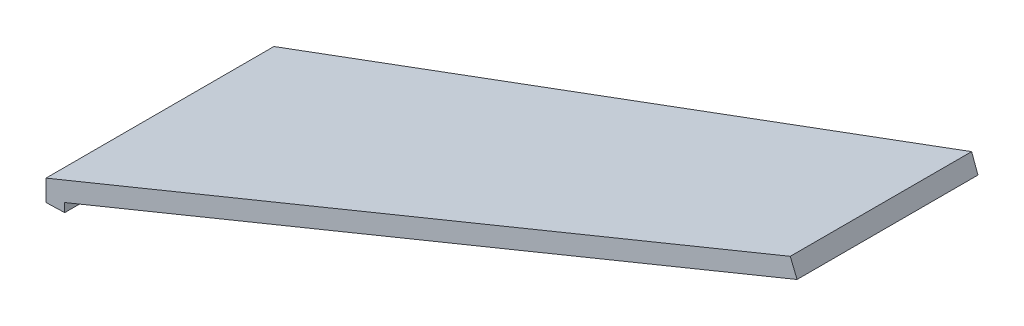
ISO-10303-21;
HEADER;
FILE_DESCRIPTION(('STEP AP214'),'2;1');
FILE_NAME('part.step','',(''),(''),'','','');
FILE_SCHEMA(('AUTOMOTIVE_DESIGN { 1 0 10303 214 1 1 1 1 }'));
ENDSEC;
DATA;
#1=APPLICATION_CONTEXT('core data for automotive mechanical design processes');
#2=APPLICATION_PROTOCOL_DEFINITION('international standard','automotive_design',2000,#1);
#3=PRODUCT_CONTEXT('',#1,'mechanical');
#4=PRODUCT('Part','Part','',(#3));
#5=PRODUCT_RELATED_PRODUCT_CATEGORY('part','',(#4));
#6=PRODUCT_DEFINITION_FORMATION('','',#4);
#7=PRODUCT_DEFINITION_CONTEXT('part definition',#1,'design');
#8=PRODUCT_DEFINITION('design','',#6,#7);
#9=PRODUCT_DEFINITION_SHAPE('','',#8);
#10=(LENGTH_UNIT() NAMED_UNIT(*) SI_UNIT(.MILLI.,.METRE.));
#11=(NAMED_UNIT(*) PLANE_ANGLE_UNIT() SI_UNIT($,.RADIAN.));
#12=(NAMED_UNIT(*) SI_UNIT($,.STERADIAN.) SOLID_ANGLE_UNIT());
#13=UNCERTAINTY_MEASURE_WITH_UNIT(LENGTH_MEASURE(1.E-05),#10,'distance_accuracy_value','');
#14=(GEOMETRIC_REPRESENTATION_CONTEXT(3) GLOBAL_UNCERTAINTY_ASSIGNED_CONTEXT((#13)) GLOBAL_UNIT_ASSIGNED_CONTEXT((#10,
#11,#12)) REPRESENTATION_CONTEXT('',''));
#15=CARTESIAN_POINT('',(0.,0.,0.));
#16=DIRECTION('',(0.,0.,1.));
#17=DIRECTION('',(1.,0.,0.));
#18=AXIS2_PLACEMENT_3D('',#15,#16,#17);
#19=CARTESIAN_POINT('',(-0.3,0.35,-2.));
#20=DIRECTION('',(-0.363251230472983,0.931691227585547,0.));
#21=DIRECTION('',(-0.931691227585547,-0.363251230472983,0.));
#22=AXIS2_PLACEMENT_3D('',#19,#20,#21);
#23=PLANE('',#22);
#24=DIRECTION('',(0.,0.,1.));
#25=VECTOR('',#24,1.);
#26=CARTESIAN_POINT('',(11.625647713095,4.99961575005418,-2.));
#27=LINE('',#26,#25);
#28=CARTESIAN_POINT('',(11.625647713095,4.99961575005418,-1.49991532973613));
#29=VERTEX_POINT('',#28);
#30=CARTESIAN_POINT('',(11.625647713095,4.99961575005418,1.49991532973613));
#31=VERTEX_POINT('',#30);
#32=EDGE_CURVE('E10',#29,#31,#27,.T.);
#33=ORIENTED_EDGE('',*,*,#32,.F.);
#34=DIRECTION('',(-0.931269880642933,-0.363086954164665,-0.0300711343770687));
#35=VECTOR('',#34,1.);
#36=CARTESIAN_POINT('',(-0.303220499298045,0.348744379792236,-1.88510399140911));
#37=LINE('',#36,#35);
#38=CARTESIAN_POINT('',(-0.3,0.35,-1.885));
#39=VERTEX_POINT('',#38);
#40=EDGE_CURVE('E108',#29,#39,#37,.T.);
#41=ORIENTED_EDGE('',*,*,#40,.T.);
#42=DIRECTION('',(0.,0.,1.));
#43=VECTOR('',#42,1.);
#44=CARTESIAN_POINT('',(-0.3,0.35,-2.));
#45=LINE('',#44,#43);
#46=CARTESIAN_POINT('',(-0.3,0.35,1.885));
#47=VERTEX_POINT('',#46);
#48=EDGE_CURVE('E19',#39,#47,#45,.T.);
#49=ORIENTED_EDGE('',*,*,#48,.T.);
#50=DIRECTION('',(0.931269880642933,0.363086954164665,-0.0300711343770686));
#51=VECTOR('',#50,1.);
#52=CARTESIAN_POINT('',(-0.191203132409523,0.392418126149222,1.88148689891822));
#53=LINE('',#52,#51);
#54=EDGE_CURVE('E94',#47,#31,#53,.T.);
#55=ORIENTED_EDGE('',*,*,#54,.T.);
#56=EDGE_LOOP('',(#33,#41,#49,#55));
#57=FACE_BOUND('',#56,.T.);
#58=ADVANCED_FACE('F16',(#57),#23,.T.);
#59=CARTESIAN_POINT('',(11.7346230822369,4.72010838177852,-2.));
#60=DIRECTION('',(0.931691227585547,0.363251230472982,0.));
#61=DIRECTION('',(-0.363251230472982,0.931691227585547,0.));
#62=AXIS2_PLACEMENT_3D('',#59,#60,#61);
#63=PLANE('',#62);
#64=DIRECTION('',(0.,0.,1.));
#65=VECTOR('',#64,1.);
#66=CARTESIAN_POINT('',(11.7346230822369,4.72010838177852,-2.));
#67=LINE('',#66,#65);
#68=CARTESIAN_POINT('',(11.7346230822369,4.72010838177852,-1.49639646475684));
#69=VERTEX_POINT('',#68);
#70=CARTESIAN_POINT('',(11.7346230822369,4.72010838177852,1.49639646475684));
#71=VERTEX_POINT('',#70);
#72=EDGE_CURVE('E24',#69,#71,#67,.T.);
#73=ORIENTED_EDGE('',*,*,#72,.F.);
#74=DIRECTION('',(-0.363226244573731,0.931627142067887,-0.0117287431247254));
#75=VECTOR('',#74,1.);
#76=CARTESIAN_POINT('',(11.7324776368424,4.72561116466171,-1.4964657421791));
#77=LINE('',#76,#75);
#78=EDGE_CURVE('E110',#69,#29,#77,.T.);
#79=ORIENTED_EDGE('',*,*,#78,.T.);
#80=ORIENTED_EDGE('',*,*,#32,.T.);
#81=DIRECTION('',(0.363226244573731,-0.931627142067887,-0.0117287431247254));
#82=VECTOR('',#81,1.);
#83=CARTESIAN_POINT('',(11.7495183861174,4.68190390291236,1.49591548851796));
#84=LINE('',#83,#82);
#85=EDGE_CURVE('E96',#31,#71,#84,.T.);
#86=ORIENTED_EDGE('',*,*,#85,.T.);
#87=EDGE_LOOP('',(#73,#79,#80,#86));
#88=FACE_BOUND('',#87,.T.);
#89=ADVANCED_FACE('F121',(#88),#63,.T.);
#90=CARTESIAN_POINT('',(0.,0.144970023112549,-2.));
#91=DIRECTION('',(0.363251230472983,-0.931691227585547,0.));
#92=DIRECTION('',(0.931691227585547,0.363251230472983,0.));
#93=AXIS2_PLACEMENT_3D('',#90,#91,#92);
#94=PLANE('',#93);
#95=DIRECTION('',(0.,0.,1.));
#96=VECTOR('',#95,1.);
#97=CARTESIAN_POINT('',(0.,0.144970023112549,-2.));
#98=LINE('',#97,#96);
#99=CARTESIAN_POINT('',(0.,0.144970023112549,-1.87531286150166));
#100=VERTEX_POINT('',#99);
#101=CARTESIAN_POINT('',(0.,0.144970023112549,1.87531286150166));
#102=VERTEX_POINT('',#101);
#103=EDGE_CURVE('E89',#100,#102,#98,.T.);
#104=ORIENTED_EDGE('',*,*,#103,.F.);
#105=DIRECTION('',(0.931269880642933,0.363086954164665,0.0300711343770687));
#106=VECTOR('',#105,1.);
#107=CARTESIAN_POINT('',(-0.00349178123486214,0.14360863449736,-1.87542561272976));
#108=LINE('',#107,#106);
#109=EDGE_CURVE('E71',#100,#69,#108,.T.);
#110=ORIENTED_EDGE('',*,*,#109,.T.);
#111=ORIENTED_EDGE('',*,*,#72,.T.);
#112=DIRECTION('',(-0.931269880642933,-0.363086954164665,0.0300711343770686));
#113=VECTOR('',#112,1.);
#114=CARTESIAN_POINT('',(0.108525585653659,0.187282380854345,1.87180852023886));
#115=LINE('',#114,#113);
#116=EDGE_CURVE('E99',#71,#102,#115,.T.);
#117=ORIENTED_EDGE('',*,*,#116,.T.);
#118=EDGE_LOOP('',(#104,#110,#111,#117));
#119=FACE_BOUND('',#118,.T.);
#120=ADVANCED_FACE('F126',(#119),#94,.T.);
#121=CARTESIAN_POINT('',(0.,0.,-2.));
#122=DIRECTION('',(1.,0.,0.));
#123=DIRECTION('',(0.,1.,0.));
#124=AXIS2_PLACEMENT_3D('',#121,#122,#123);
#125=PLANE('',#124);
#126=DIRECTION('',(0.,0.,1.));
#127=VECTOR('',#126,1.);
#128=CARTESIAN_POINT('',(0.,0.,-2.));
#129=LINE('',#128,#127);
#130=CARTESIAN_POINT('',(0.,0.,-1.87531286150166));
#131=VERTEX_POINT('',#130);
#132=CARTESIAN_POINT('',(0.,0.,1.87531286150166));
#133=VERTEX_POINT('',#132);
#134=EDGE_CURVE('E81',#131,#133,#129,.T.);
#135=ORIENTED_EDGE('',*,*,#134,.F.);
#136=DIRECTION('',(0.,1.,0.));
#137=VECTOR('',#136,1.);
#138=CARTESIAN_POINT('',(0.,0.,-1.87531286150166));
#139=LINE('',#138,#137);
#140=EDGE_CURVE('E68',#131,#100,#139,.T.);
#141=ORIENTED_EDGE('',*,*,#140,.T.);
#142=ORIENTED_EDGE('',*,*,#103,.T.);
#143=DIRECTION('',(0.,-1.,0.));
#144=VECTOR('',#143,1.);
#145=CARTESIAN_POINT('',(0.,0.,1.87531286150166));
#146=LINE('',#145,#144);
#147=EDGE_CURVE('E88',#102,#133,#146,.T.);
#148=ORIENTED_EDGE('',*,*,#147,.T.);
#149=EDGE_LOOP('',(#135,#141,#142,#148));
#150=FACE_BOUND('',#149,.T.);
#151=ADVANCED_FACE('F86',(#150),#125,.T.);
#152=CARTESIAN_POINT('',(-0.3,0.,-2.));
#153=DIRECTION('',(0.,-1.,0.));
#154=DIRECTION('',(0.,0.,-1.));
#155=AXIS2_PLACEMENT_3D('',#152,#153,#154);
#156=PLANE('',#155);
#157=DIRECTION('',(0.,0.,1.));
#158=VECTOR('',#157,1.);
#159=CARTESIAN_POINT('',(-0.3,0.,-2.));
#160=LINE('',#159,#158);
#161=CARTESIAN_POINT('',(-0.3,0.,-1.885));
#162=VERTEX_POINT('',#161);
#163=CARTESIAN_POINT('',(-0.3,0.,1.885));
#164=VERTEX_POINT('',#163);
#165=EDGE_CURVE('E83',#162,#164,#160,.T.);
#166=ORIENTED_EDGE('',*,*,#165,.F.);
#167=DIRECTION('',(0.999479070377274,0.,0.0322736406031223));
#168=VECTOR('',#167,1.);
#169=CARTESIAN_POINT('',(11.7346230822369,0.,-1.49639646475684));
#170=LINE('',#169,#168);
#171=EDGE_CURVE('E32',#162,#131,#170,.T.);
#172=ORIENTED_EDGE('',*,*,#171,.T.);
#173=ORIENTED_EDGE('',*,*,#134,.T.);
#174=DIRECTION('',(-0.999479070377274,0.,0.0322736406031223));
#175=VECTOR('',#174,1.);
#176=CARTESIAN_POINT('',(11.7346230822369,0.,1.49639646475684));
#177=LINE('',#176,#175);
#178=EDGE_CURVE('E106',#133,#164,#177,.T.);
#179=ORIENTED_EDGE('',*,*,#178,.T.);
#180=EDGE_LOOP('',(#166,#172,#173,#179));
#181=FACE_BOUND('',#180,.T.);
#182=ADVANCED_FACE('F79',(#181),#156,.T.);
#183=CARTESIAN_POINT('',(-0.3,0.35,-2.));
#184=DIRECTION('',(-1.,0.,0.));
#185=DIRECTION('',(0.,-1.,0.));
#186=AXIS2_PLACEMENT_3D('',#183,#184,#185);
#187=PLANE('',#186);
#188=ORIENTED_EDGE('',*,*,#48,.F.);
#189=DIRECTION('',(0.,-1.,0.));
#190=VECTOR('',#189,1.);
#191=CARTESIAN_POINT('',(-0.3,4.99961575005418,-1.885));
#192=LINE('',#191,#190);
#193=EDGE_CURVE('E75',#39,#162,#192,.T.);
#194=ORIENTED_EDGE('',*,*,#193,.T.);
#195=ORIENTED_EDGE('',*,*,#165,.T.);
#196=DIRECTION('',(0.,-1.,0.));
#197=VECTOR('',#196,1.);
#198=CARTESIAN_POINT('',(-0.3,4.99961575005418,1.885));
#199=LINE('',#198,#197);
#200=EDGE_CURVE('E103',#47,#164,#199,.T.);
#201=ORIENTED_EDGE('',*,*,#200,.F.);
#202=EDGE_LOOP('',(#188,#194,#195,#201));
#203=FACE_BOUND('',#202,.T.);
#204=ADVANCED_FACE('F115',(#203),#187,.T.);
#205=CARTESIAN_POINT('',(11.7346230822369,4.99961575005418,1.49639646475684));
#206=DIRECTION('',(0.0322736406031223,0.,0.999479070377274));
#207=DIRECTION('',(0.999479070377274,0.,-0.0322736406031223));
#208=AXIS2_PLACEMENT_3D('',#205,#206,#207);
#209=PLANE('',#208);
#210=ORIENTED_EDGE('',*,*,#200,.T.);
#211=ORIENTED_EDGE('',*,*,#178,.F.);
#212=ORIENTED_EDGE('',*,*,#147,.F.);
#213=ORIENTED_EDGE('',*,*,#116,.F.);
#214=ORIENTED_EDGE('',*,*,#85,.F.);
#215=ORIENTED_EDGE('',*,*,#54,.F.);
#216=EDGE_LOOP('',(#210,#211,#212,#213,#214,#215));
#217=FACE_BOUND('',#216,.T.);
#218=ADVANCED_FACE('F124',(#217),#209,.T.);
#219=CARTESIAN_POINT('',(11.7346230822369,4.99961575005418,-1.49639646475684));
#220=DIRECTION('',(0.0322736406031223,0.,-0.999479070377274));
#221=DIRECTION('',(-0.999479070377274,0.,-0.0322736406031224));
#222=AXIS2_PLACEMENT_3D('',#219,#220,#221);
#223=PLANE('',#222);
#224=ORIENTED_EDGE('',*,*,#78,.F.);
#225=ORIENTED_EDGE('',*,*,#109,.F.);
#226=ORIENTED_EDGE('',*,*,#140,.F.);
#227=ORIENTED_EDGE('',*,*,#171,.F.);
#228=ORIENTED_EDGE('',*,*,#193,.F.);
#229=ORIENTED_EDGE('',*,*,#40,.F.);
#230=EDGE_LOOP('',(#224,#225,#226,#227,#228,#229));
#231=FACE_BOUND('',#230,.T.);
#232=ADVANCED_FACE('F69',(#231),#223,.T.);
#233=CLOSED_SHELL('',(#58,#89,#120,#151,#182,#204,#218,#232));
#234=MANIFOLD_SOLID_BREP('B1',#233);
#235=ADVANCED_BREP_SHAPE_REPRESENTATION('',(#18,#234),#14);
#236=SHAPE_DEFINITION_REPRESENTATION(#9,#235);
ENDSEC;
END-ISO-10303-21;
